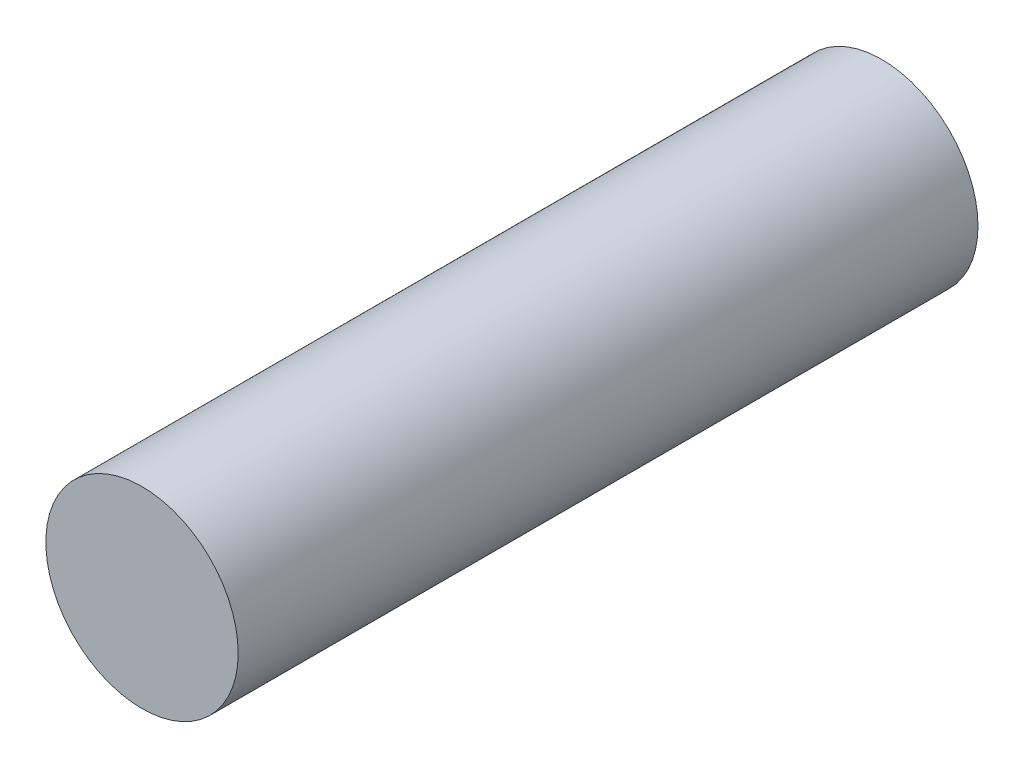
from build123d import *

# Parameters (mm, degrees)
SZKIC1_R                    = 13
DODANIE_WYCI_GNI_CIE1_DEPTH = 100


with BuildPart() as part:
    # Szkic1 → Dodanie-wyci_gni_cie1 (new body)
    with BuildSketch(Plane.XY):
        Circle(SZKIC1_R)
    extrude(amount=DODANIE_WYCI_GNI_CIE1_DEPTH)


solid = part.part
